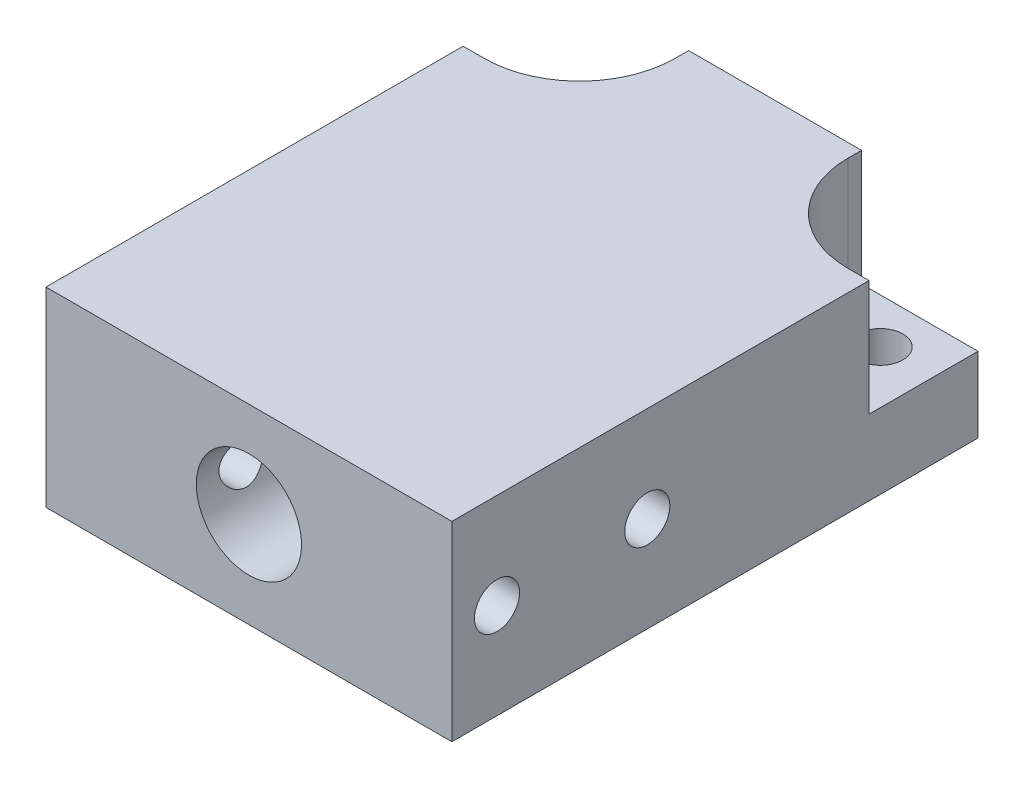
from build123d import *

# Parameters (mm, degrees)
SKETCH1_W                        = 27
SKETCH1_H                        = 35
BOSS_EXTRUDE1_DEPTH              = 6.35
CUT_EXTRUDE1_DEPTH               = 39.046977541
CUT_EXTRUDE1_DEPTH_BACK          = 39.046977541
SKETCH2_R                        = 3.5
CUT_EXTRUDE2_DEPTH               = 33.795922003
CUT_EXTRUDE2_DEPTH_BACK          = 33.795922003
SKETCH3_R                        = 1.5
CUT_EXTRUDE3_DEPTH               = 26.490978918
CUT_EXTRUDE3_DEPTH_BACK          = 26.490978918
SKETCH4_R                        = 1.5
TAP_DRILL_FOR_M10X1_0_TAP1_D     = 9
TAP_DRILL_FOR_M10X1_0_TAP1_DEPTH = 6
TAP_DRILL_FOR_M10X1_0_TAP1_TIP   = 2.703872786
SKETCH11_W                       = 7.75
SKETCH11_H                       = 7.25
CUT_EXTRUDE4_DEPTH               = 7.7
FILLET3_R                        = 6.35


with BuildPart() as part:
    # Sketch1 → Boss-Extrude1 (new, symmetric)
    with BuildSketch(Plane(origin=(0, 0, 0), x_dir=(1, 0, 0), z_dir=(0, 1, 0))):
        Rectangle(SKETCH1_W, SKETCH1_H)
    extrude(amount=BOSS_EXTRUDE1_DEPTH, both=True)

    # Sketch2 → Cut-Extrude1 (cut, two sides: drawn at the far end of the back side and taken through both)
    with BuildSketch(Plane(origin=(0, 0, -17.5), x_dir=(-1, 0, 0), z_dir=(0, 0, -1)).offset(-CUT_EXTRUDE1_DEPTH_BACK)):
        Circle(SKETCH2_R)
    extrude(amount=CUT_EXTRUDE1_DEPTH + CUT_EXTRUDE1_DEPTH_BACK, mode=Mode.SUBTRACT)

    # Sketch3 → Cut-Extrude2 (cut, two sides: drawn at the far end of the back side and taken through both)
    with BuildSketch(Plane(origin=(13.5, 0, 0), x_dir=(0, 0, -1), z_dir=(1, 0, 0)).offset(-CUT_EXTRUDE2_DEPTH_BACK)):
        with Locations((-4.5, 0)):
            Circle(SKETCH3_R)
        with Locations((-14.5, 0)):
            Circle(SKETCH3_R)
    extrude(amount=CUT_EXTRUDE2_DEPTH + CUT_EXTRUDE2_DEPTH_BACK, mode=Mode.SUBTRACT)

    # Sketch4 → Cut-Extrude3 (cut, two sides: drawn at the far end of the back side and taken through both)
    with BuildSketch(Plane(origin=(0, 6.35, 0), x_dir=(1, 0, 0), z_dir=(0, 1, 0)).offset(-CUT_EXTRUDE3_DEPTH_BACK)):
        with Locations(Location((-10, 14.5, 0), (0, 0, 270))):
            Circle(SKETCH4_R)
        with Locations(Location((10, 14.5, 0), (0, 0, 270))):
            Circle(SKETCH4_R)
    extrude(amount=CUT_EXTRUDE3_DEPTH + CUT_EXTRUDE3_DEPTH_BACK, mode=Mode.SUBTRACT)

    # Tap Drill for M10x1.0 Tap1
    with Locations(Plane(origin=(0, 0, -17.5), x_dir=(-1, 0, 0), z_dir=(0, 0, -1))):
        with Locations((0, 0)):
            Hole(TAP_DRILL_FOR_M10X1_0_TAP1_D / 2, depth=TAP_DRILL_FOR_M10X1_0_TAP1_DEPTH)
            with Locations((0, 0, -(TAP_DRILL_FOR_M10X1_0_TAP1_DEPTH + TAP_DRILL_FOR_M10X1_0_TAP1_TIP / 2))):  # 118° drill point
                Cone(0, TAP_DRILL_FOR_M10X1_0_TAP1_D / 2, TAP_DRILL_FOR_M10X1_0_TAP1_TIP, mode=Mode.SUBTRACT)

    # Sketch11 → Cut-Extrude4 (cut)
    with BuildSketch(Plane(origin=(0, 6.35, 0), x_dir=(1, 0, 0), z_dir=(0, 1, 0))):
        with Locations((-9.625, 13.875)):
            Rectangle(SKETCH11_W, SKETCH11_H)
        with Locations((9.625, 13.875)):
            Rectangle(SKETCH11_W, SKETCH11_H)
    extrude(amount=-CUT_EXTRUDE4_DEPTH, mode=Mode.SUBTRACT)

    # Fillet3
    fillet3_edges = [part.edges().sort_by_distance(p)[0] for p in [
        (-5.75, 2.5, -10.25),
        (5.75, 2.5, -10.25),
    ]]
    fillet(fillet3_edges, radius=FILLET3_R)


solid = part.part
